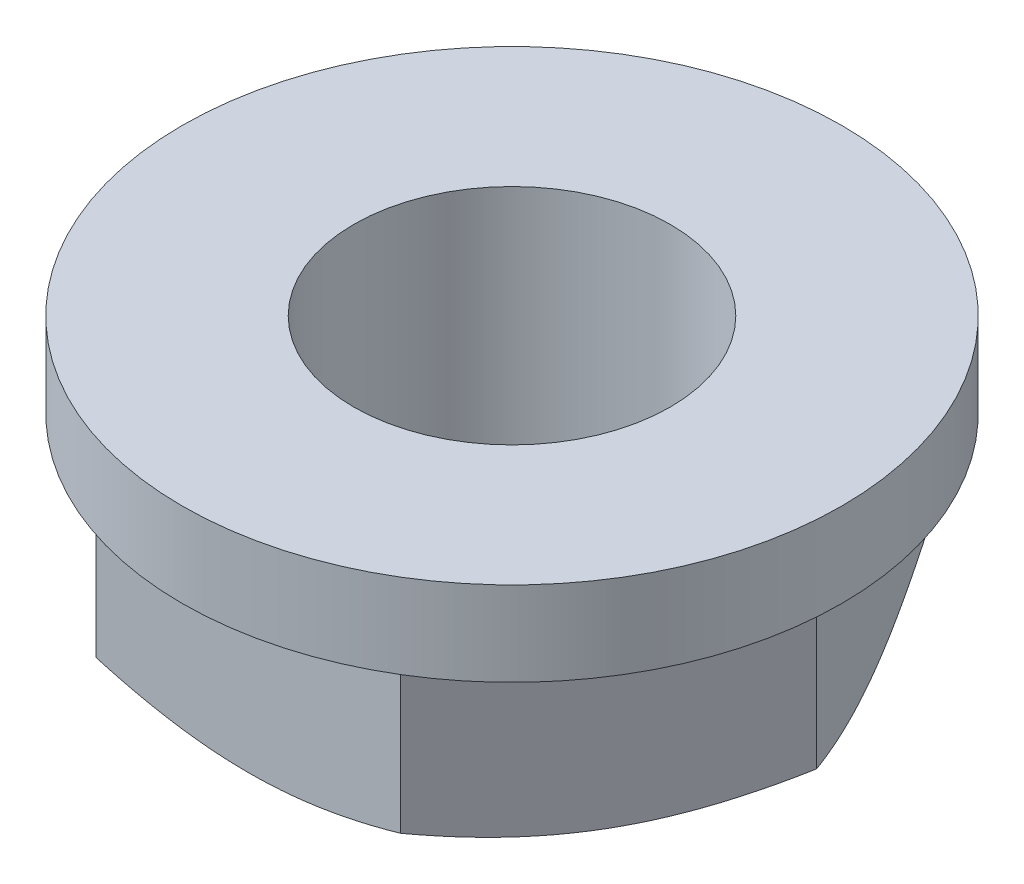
ISO-10303-21;
HEADER;
FILE_DESCRIPTION(('STEP AP214'),'2;1');
FILE_NAME('part.step','',(''),(''),'','','');
FILE_SCHEMA(('AUTOMOTIVE_DESIGN { 1 0 10303 214 1 1 1 1 }'));
ENDSEC;
DATA;
#1=APPLICATION_CONTEXT('core data for automotive mechanical design processes');
#2=APPLICATION_PROTOCOL_DEFINITION('international standard','automotive_design',2000,#1);
#3=PRODUCT_CONTEXT('',#1,'mechanical');
#4=PRODUCT('Part','Part','',(#3));
#5=PRODUCT_RELATED_PRODUCT_CATEGORY('part','',(#4));
#6=PRODUCT_DEFINITION_FORMATION('','',#4);
#7=PRODUCT_DEFINITION_CONTEXT('part definition',#1,'design');
#8=PRODUCT_DEFINITION('design','',#6,#7);
#9=PRODUCT_DEFINITION_SHAPE('','',#8);
#10=(LENGTH_UNIT() NAMED_UNIT(*) SI_UNIT(.MILLI.,.METRE.));
#11=(NAMED_UNIT(*) PLANE_ANGLE_UNIT() SI_UNIT($,.RADIAN.));
#12=(NAMED_UNIT(*) SI_UNIT($,.STERADIAN.) SOLID_ANGLE_UNIT());
#13=UNCERTAINTY_MEASURE_WITH_UNIT(LENGTH_MEASURE(1.E-05),#10,'distance_accuracy_value','');
#14=(GEOMETRIC_REPRESENTATION_CONTEXT(3) GLOBAL_UNCERTAINTY_ASSIGNED_CONTEXT((#13)) GLOBAL_UNIT_ASSIGNED_CONTEXT((#10,
#11,#12)) REPRESENTATION_CONTEXT('',''));
#15=CARTESIAN_POINT('',(0.,0.,0.));
#16=DIRECTION('',(0.,0.,1.));
#17=DIRECTION('',(1.,0.,0.));
#18=AXIS2_PLACEMENT_3D('',#15,#16,#17);
#19=CARTESIAN_POINT('',(0.,-4.77627677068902,0.));
#20=DIRECTION('',(0.,1.,0.));
#21=DIRECTION('',(-1.,0.,0.));
#22=AXIS2_PLACEMENT_3D('',#19,#20,#21);
#23=CONICAL_SURFACE('',#22,5.3875,1.0471975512);
#24=CARTESIAN_POINT('',(0.,-5.00000000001,5.00000000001));
#25=CARTESIAN_POINT('',(-1.33974596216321,-5.00000000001,5.00000000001));
#26=CARTESIAN_POINT('',(-2.88675134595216,-4.55341801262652,5.00000000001));
#27=(BOUNDED_CURVE() B_SPLINE_CURVE(2,(#24,#25,#26),.UNSPECIFIED.,.F.,
.F.) B_SPLINE_CURVE_WITH_KNOTS((3,3),(2.9316581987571,5.86058663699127),
.UNSPECIFIED.) CURVE() GEOMETRIC_REPRESENTATION_ITEM() RATIONAL_B_SPLINE_CURVE((1.,
1.03799156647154,1.00007075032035)) REPRESENTATION_ITEM(''));
#28=CARTESIAN_POINT('',(0.,-5.,5.));
#29=VERTEX_POINT('',#28);
#30=CARTESIAN_POINT('',(-2.88675134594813,-4.5534180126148,5.));
#31=VERTEX_POINT('',#30);
#32=EDGE_CURVE('E30',#29,#31,#27,.T.);
#33=ORIENTED_EDGE('',*,*,#32,.T.);
#34=CARTESIAN_POINT('',(-2.88675134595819,-4.55341801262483,5.0000000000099));
#35=CARTESIAN_POINT('',(-3.66025403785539,-5.0000000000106,3.66025403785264));
#36=CARTESIAN_POINT('',(-4.3301270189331,-5.00000000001,2.50000000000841));
#37=(BOUNDED_CURVE() B_SPLINE_CURVE(2,(#34,#35,#36),.UNSPECIFIED.,.F.,
.F.) B_SPLINE_CURVE_WITH_KNOTS((3,3),(0.00272976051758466,2.93165819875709),
.UNSPECIFIED.) CURVE() GEOMETRIC_REPRESENTATION_ITEM() RATIONAL_B_SPLINE_CURVE((1.00007075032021,
1.03799156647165,0.99999999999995)) REPRESENTATION_ITEM(''));
#38=CARTESIAN_POINT('',(-4.33012701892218,-5.,2.5));
#39=VERTEX_POINT('',#38);
#40=EDGE_CURVE('E204',#31,#39,#37,.T.);
#41=ORIENTED_EDGE('',*,*,#40,.T.);
#42=CARTESIAN_POINT('',(0.,-5.00000000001,0.));
#43=DIRECTION('',(0.,-1.,0.));
#44=DIRECTION('',(-1.,0.,0.));
#45=AXIS2_PLACEMENT_3D('',#42,#43,#44);
#46=CIRCLE('',#45,5.);
#47=EDGE_CURVE('E22',#29,#39,#46,.T.);
#48=ORIENTED_EDGE('',*,*,#47,.F.);
#49=EDGE_LOOP('',(#33,#41,#48));
#50=FACE_BOUND('',#49,.T.);
#51=ADVANCED_FACE('F18',(#50),#23,.T.);
#52=CARTESIAN_POINT('',(4.3301270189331,-5.00000000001,-2.50000000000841));
#53=CARTESIAN_POINT('',(5.00000000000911,-5.0000000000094,-1.33974596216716));
#54=CARTESIAN_POINT('',(5.7735026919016,-4.5534180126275,1.89407645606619E-12));
#55=(BOUNDED_CURVE() B_SPLINE_CURVE(2,(#52,#53,#54),.UNSPECIFIED.,.F.,
.F.) B_SPLINE_CURVE_WITH_KNOTS((3,3),(2.9316581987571,5.86058663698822),
.UNSPECIFIED.) CURVE() GEOMETRIC_REPRESENTATION_ITEM() RATIONAL_B_SPLINE_CURVE((1.00000000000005,
1.03799156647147,1.00007075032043)) REPRESENTATION_ITEM(''));
#56=CARTESIAN_POINT('',(4.33012701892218,-5.,-2.5));
#57=VERTEX_POINT('',#56);
#58=CARTESIAN_POINT('',(5.77350269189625,-4.5534180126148,0.));
#59=VERTEX_POINT('',#58);
#60=EDGE_CURVE('E152',#57,#59,#55,.T.);
#61=ORIENTED_EDGE('',*,*,#60,.T.);
#62=CARTESIAN_POINT('',(5.7735026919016,-4.5534180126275,-1.8916515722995E-12));
#63=CARTESIAN_POINT('',(5.00000000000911,-5.0000000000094,1.33974596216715));
#64=CARTESIAN_POINT('',(4.33012701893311,-5.00000000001,2.50000000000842));
#65=(BOUNDED_CURVE() B_SPLINE_CURVE(2,(#62,#63,#64),.UNSPECIFIED.,.F.,
.F.) B_SPLINE_CURVE_WITH_KNOTS((3,3),(0.00272976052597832,2.93165819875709),
.UNSPECIFIED.) CURVE() GEOMETRIC_REPRESENTATION_ITEM() RATIONAL_B_SPLINE_CURVE((1.00007075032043,
1.03799156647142,1.00000000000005)) REPRESENTATION_ITEM(''));
#66=CARTESIAN_POINT('',(4.3301270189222,-5.,2.5));
#67=VERTEX_POINT('',#66);
#68=EDGE_CURVE('E160',#59,#67,#65,.T.);
#69=ORIENTED_EDGE('',*,*,#68,.T.);
#70=EDGE_CURVE('E165',#57,#67,#46,.T.);
#71=ORIENTED_EDGE('',*,*,#70,.F.);
#72=EDGE_LOOP('',(#61,#69,#71));
#73=FACE_BOUND('',#72,.T.);
#74=ADVANCED_FACE('F20',(#73),#23,.T.);
#75=CARTESIAN_POINT('',(2.88675134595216,-4.55341801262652,5.00000000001));
#76=CARTESIAN_POINT('',(1.33974596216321,-5.00000000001,5.00000000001));
#77=CARTESIAN_POINT('',(0.,-5.00000000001,5.00000000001));
#78=(BOUNDED_CURVE() B_SPLINE_CURVE(2,(#75,#76,#77),.UNSPECIFIED.,.F.,
.F.) B_SPLINE_CURVE_WITH_KNOTS((3,3),(0.00272976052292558,2.9316581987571),
.UNSPECIFIED.) CURVE() GEOMETRIC_REPRESENTATION_ITEM() RATIONAL_B_SPLINE_CURVE((1.00007075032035,
1.03799156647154,1.)) REPRESENTATION_ITEM(''));
#79=CARTESIAN_POINT('',(2.88675134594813,-4.5534180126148,5.));
#80=VERTEX_POINT('',#79);
#81=EDGE_CURVE('E11',#80,#29,#78,.T.);
#82=ORIENTED_EDGE('',*,*,#81,.T.);
#83=EDGE_CURVE('E217',#67,#29,#46,.T.);
#84=ORIENTED_EDGE('',*,*,#83,.F.);
#85=CARTESIAN_POINT('',(4.33012701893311,-5.00000000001,2.50000000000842));
#86=CARTESIAN_POINT('',(3.66025403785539,-5.0000000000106,3.66025403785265));
#87=CARTESIAN_POINT('',(2.88675134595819,-4.55341801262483,5.00000000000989));
#88=(BOUNDED_CURVE() B_SPLINE_CURVE(2,(#85,#86,#87),.UNSPECIFIED.,.F.,
.F.) B_SPLINE_CURVE_WITH_KNOTS((3,3),(2.93165819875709,5.86058663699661),
.UNSPECIFIED.) CURVE() GEOMETRIC_REPRESENTATION_ITEM() RATIONAL_B_SPLINE_CURVE((0.99999999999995,
1.03799156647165,1.00007075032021)) REPRESENTATION_ITEM(''));
#89=EDGE_CURVE('E211',#67,#80,#88,.T.);
#90=ORIENTED_EDGE('',*,*,#89,.T.);
#91=EDGE_LOOP('',(#82,#84,#90));
#92=FACE_BOUND('',#91,.T.);
#93=ADVANCED_FACE('F261',(#92),#23,.T.);
#94=CARTESIAN_POINT('',(0.,1.,5.));
#95=DIRECTION('',(0.,0.,1.));
#96=DIRECTION('',(1.,0.,0.));
#97=AXIS2_PLACEMENT_3D('',#94,#95,#96);
#98=PLANE('',#97);
#99=DIRECTION('',(-1.,0.,0.));
#100=VECTOR('',#99,1.);
#101=CARTESIAN_POINT('',(2.36250000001,-1.60000000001,5.00000000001));
#102=LINE('',#101,#100);
#103=CARTESIAN_POINT('',(2.88675134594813,-1.6,5.));
#104=VERTEX_POINT('',#103);
#105=CARTESIAN_POINT('',(-2.88675134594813,-1.6,5.));
#106=VERTEX_POINT('',#105);
#107=EDGE_CURVE('E134',#104,#106,#102,.T.);
#108=ORIENTED_EDGE('',*,*,#107,.T.);
#109=DIRECTION('',(0.,-1.,0.));
#110=VECTOR('',#109,1.);
#111=CARTESIAN_POINT('',(-2.88675134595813,0.99999999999,5.00000000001));
#112=LINE('',#111,#110);
#113=EDGE_CURVE('E201',#106,#31,#112,.T.);
#114=ORIENTED_EDGE('',*,*,#113,.T.);
#115=ORIENTED_EDGE('',*,*,#32,.F.);
#116=ORIENTED_EDGE('',*,*,#81,.F.);
#117=DIRECTION('',(0.,-1.,0.));
#118=VECTOR('',#117,1.);
#119=CARTESIAN_POINT('',(2.88675134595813,0.99999999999,5.00000000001));
#120=LINE('',#119,#118);
#121=EDGE_CURVE('E207',#104,#80,#120,.T.);
#122=ORIENTED_EDGE('',*,*,#121,.F.);
#123=EDGE_LOOP('',(#108,#114,#115,#116,#122));
#124=FACE_BOUND('',#123,.T.);
#125=ADVANCED_FACE('F358',(#124),#98,.T.);
#126=CARTESIAN_POINT('',(2.88675134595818,-4.55341801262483,-5.00000000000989));
#127=CARTESIAN_POINT('',(3.66025403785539,-5.0000000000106,-3.66025403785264));
#128=CARTESIAN_POINT('',(4.33012701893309,-5.00000000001,-2.50000000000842));
#129=(BOUNDED_CURVE() B_SPLINE_CURVE(2,(#126,#127,#128),.UNSPECIFIED.,.F.,
.F.) B_SPLINE_CURVE_WITH_KNOTS((3,3),(0.00272976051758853,2.9316581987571),
.UNSPECIFIED.) CURVE() GEOMETRIC_REPRESENTATION_ITEM() RATIONAL_B_SPLINE_CURVE((1.00007075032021,
1.03799156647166,0.99999999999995)) REPRESENTATION_ITEM(''));
#130=CARTESIAN_POINT('',(2.88675134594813,-4.5534180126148,-5.));
#131=VERTEX_POINT('',#130);
#132=EDGE_CURVE('E104',#131,#57,#129,.T.);
#133=ORIENTED_EDGE('',*,*,#132,.T.);
#134=CARTESIAN_POINT('',(0.,-5.,-5.));
#135=VERTEX_POINT('',#134);
#136=EDGE_CURVE('E176',#135,#57,#46,.T.);
#137=ORIENTED_EDGE('',*,*,#136,.F.);
#138=CARTESIAN_POINT('',(0.,-5.00000000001,-5.00000000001));
#139=CARTESIAN_POINT('',(1.3397459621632,-5.00000000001,-5.00000000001));
#140=CARTESIAN_POINT('',(2.88675134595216,-4.55341801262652,-5.00000000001));
#141=(BOUNDED_CURVE() B_SPLINE_CURVE(2,(#138,#139,#140),.UNSPECIFIED.,.F.,
.F.) B_SPLINE_CURVE_WITH_KNOTS((3,3),(2.9316581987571,5.86058663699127),
.UNSPECIFIED.) CURVE() GEOMETRIC_REPRESENTATION_ITEM() RATIONAL_B_SPLINE_CURVE((1.,
1.03799156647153,1.00007075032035)) REPRESENTATION_ITEM(''));
#142=EDGE_CURVE('E185',#135,#131,#141,.T.);
#143=ORIENTED_EDGE('',*,*,#142,.T.);
#144=EDGE_LOOP('',(#133,#137,#143));
#145=FACE_BOUND('',#144,.T.);
#146=ADVANCED_FACE('F356',(#145),#23,.T.);
#147=CARTESIAN_POINT('',(-4.33012701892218,1.,-2.5));
#148=DIRECTION('',(-0.866025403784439,0.,-0.5));
#149=DIRECTION('',(-0.5,0.,0.866025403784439));
#150=AXIS2_PLACEMENT_3D('',#147,#148,#149);
#151=PLANE('',#150);
#152=DIRECTION('',(0.50000000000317,0.,-0.866025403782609));
#153=VECTOR('',#152,1.);
#154=CARTESIAN_POINT('',(-3.7395020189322,-1.60000000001,-3.52299250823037));
#155=LINE('',#154,#153);
#156=CARTESIAN_POINT('',(-5.77350269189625,-1.6,0.));
#157=VERTEX_POINT('',#156);
#158=CARTESIAN_POINT('',(-2.88675134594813,-1.6,-5.));
#159=VERTEX_POINT('',#158);
#160=EDGE_CURVE('E118',#157,#159,#155,.T.);
#161=ORIENTED_EDGE('',*,*,#160,.T.);
#162=DIRECTION('',(0.,-1.,0.));
#163=VECTOR('',#162,1.);
#164=CARTESIAN_POINT('',(-2.88675134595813,0.99999999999,-5.00000000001));
#165=LINE('',#164,#163);
#166=CARTESIAN_POINT('',(-2.88675134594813,-4.5534180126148,-5.));
#167=VERTEX_POINT('',#166);
#168=EDGE_CURVE('E113',#159,#167,#165,.T.);
#169=ORIENTED_EDGE('',*,*,#168,.T.);
#170=CARTESIAN_POINT('',(-4.3301270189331,-5.00000000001,-2.50000000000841));
#171=CARTESIAN_POINT('',(-3.66025403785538,-5.0000000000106,-3.66025403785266));
#172=CARTESIAN_POINT('',(-2.88675134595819,-4.55341801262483,-5.00000000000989));
#173=(BOUNDED_CURVE() B_SPLINE_CURVE(2,(#170,#171,#172),.UNSPECIFIED.,.F.,
.F.) B_SPLINE_CURVE_WITH_KNOTS((3,3),(2.9316581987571,5.86058663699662),
.UNSPECIFIED.) CURVE() GEOMETRIC_REPRESENTATION_ITEM() RATIONAL_B_SPLINE_CURVE((0.99999999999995,
1.03799156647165,1.00007075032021)) REPRESENTATION_ITEM(''));
#174=CARTESIAN_POINT('',(-4.33012701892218,-5.,-2.5));
#175=VERTEX_POINT('',#174);
#176=EDGE_CURVE('E224',#175,#167,#173,.T.);
#177=ORIENTED_EDGE('',*,*,#176,.F.);
#178=CARTESIAN_POINT('',(-5.7735026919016,-4.5534180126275,1.89292499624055E-12));
#179=CARTESIAN_POINT('',(-5.00000000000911,-5.0000000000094,-1.33974596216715));
#180=CARTESIAN_POINT('',(-4.3301270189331,-5.00000000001,-2.50000000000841));
#181=(BOUNDED_CURVE() B_SPLINE_CURVE(2,(#178,#179,#180),.UNSPECIFIED.,.F.,
.F.) B_SPLINE_CURVE_WITH_KNOTS((3,3),(0.0027297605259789,2.9316581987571),
.UNSPECIFIED.) CURVE() GEOMETRIC_REPRESENTATION_ITEM() RATIONAL_B_SPLINE_CURVE((1.00007075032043,
1.03799156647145,1.00000000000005)) REPRESENTATION_ITEM(''));
#182=CARTESIAN_POINT('',(-5.77350269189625,-4.5534180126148,0.));
#183=VERTEX_POINT('',#182);
#184=EDGE_CURVE('E301',#183,#175,#181,.T.);
#185=ORIENTED_EDGE('',*,*,#184,.F.);
#186=DIRECTION('',(0.,-1.,0.));
#187=VECTOR('',#186,1.);
#188=CARTESIAN_POINT('',(-5.77350269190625,0.99999999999,1.00003535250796E-11));
#189=LINE('',#188,#187);
#190=EDGE_CURVE('E63',#157,#183,#189,.T.);
#191=ORIENTED_EDGE('',*,*,#190,.F.);
#192=EDGE_LOOP('',(#161,#169,#177,#185,#191));
#193=FACE_BOUND('',#192,.T.);
#194=ADVANCED_FACE('F354',(#193),#151,.T.);
#195=CARTESIAN_POINT('',(-4.33012701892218,1.,2.5));
#196=DIRECTION('',(-0.866025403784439,0.,0.5));
#197=DIRECTION('',(0.,1.,0.));
#198=AXIS2_PLACEMENT_3D('',#195,#196,#197);
#199=PLANE('',#198);
#200=DIRECTION('',(-0.50000000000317,0.,-0.866025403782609));
#201=VECTOR('',#200,1.);
#202=CARTESIAN_POINT('',(-3.7395020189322,-1.60000000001,3.52299250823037));
#203=LINE('',#202,#201);
#204=EDGE_CURVE('E145',#106,#157,#203,.T.);
#205=ORIENTED_EDGE('',*,*,#204,.T.);
#206=ORIENTED_EDGE('',*,*,#190,.T.);
#207=CARTESIAN_POINT('',(-4.3301270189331,-5.00000000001,2.50000000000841));
#208=CARTESIAN_POINT('',(-5.00000000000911,-5.0000000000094,1.33974596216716));
#209=CARTESIAN_POINT('',(-5.77350269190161,-4.55341801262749,-1.89365932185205E-12));
#210=(BOUNDED_CURVE() B_SPLINE_CURVE(2,(#207,#208,#209),.UNSPECIFIED.,.F.,
.F.) B_SPLINE_CURVE_WITH_KNOTS((3,3),(2.93165819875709,5.86058663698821),
.UNSPECIFIED.) CURVE() GEOMETRIC_REPRESENTATION_ITEM() RATIONAL_B_SPLINE_CURVE((1.00000000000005,
1.03799156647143,1.00007075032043)) REPRESENTATION_ITEM(''));
#211=EDGE_CURVE('E159',#39,#183,#210,.T.);
#212=ORIENTED_EDGE('',*,*,#211,.F.);
#213=ORIENTED_EDGE('',*,*,#40,.F.);
#214=ORIENTED_EDGE('',*,*,#113,.F.);
#215=EDGE_LOOP('',(#205,#206,#212,#213,#214));
#216=FACE_BOUND('',#215,.T.);
#217=ADVANCED_FACE('F351',(#216),#199,.T.);
#218=CARTESIAN_POINT('',(0.,1.,-5.));
#219=DIRECTION('',(0.,0.,-1.));
#220=DIRECTION('',(0.,-1.,0.));
#221=AXIS2_PLACEMENT_3D('',#218,#219,#220);
#222=PLANE('',#221);
#223=DIRECTION('',(1.,0.,0.));
#224=VECTOR('',#223,1.);
#225=CARTESIAN_POINT('',(2.36250000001,-1.60000000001,-5.00000000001));
#226=LINE('',#225,#224);
#227=CARTESIAN_POINT('',(2.88675134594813,-1.6,-5.));
#228=VERTEX_POINT('',#227);
#229=EDGE_CURVE('E110',#159,#228,#226,.T.);
#230=ORIENTED_EDGE('',*,*,#229,.T.);
#231=DIRECTION('',(0.,-1.,0.));
#232=VECTOR('',#231,1.);
#233=CARTESIAN_POINT('',(2.88675134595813,0.99999999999,-5.00000000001));
#234=LINE('',#233,#232);
#235=EDGE_CURVE('E95',#228,#131,#234,.T.);
#236=ORIENTED_EDGE('',*,*,#235,.T.);
#237=ORIENTED_EDGE('',*,*,#142,.F.);
#238=CARTESIAN_POINT('',(-2.88675134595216,-4.55341801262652,-5.00000000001));
#239=CARTESIAN_POINT('',(-1.33974596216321,-5.00000000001,-5.00000000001));
#240=CARTESIAN_POINT('',(0.,-5.00000000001,-5.00000000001));
#241=(BOUNDED_CURVE() B_SPLINE_CURVE(2,(#238,#239,#240),.UNSPECIFIED.,.F.,
.F.) B_SPLINE_CURVE_WITH_KNOTS((3,3),(0.00272976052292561,2.9316581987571),
.UNSPECIFIED.) CURVE() GEOMETRIC_REPRESENTATION_ITEM() RATIONAL_B_SPLINE_CURVE((1.00007075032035,
1.03799156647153,1.)) REPRESENTATION_ITEM(''));
#242=EDGE_CURVE('E188',#167,#135,#241,.T.);
#243=ORIENTED_EDGE('',*,*,#242,.F.);
#244=ORIENTED_EDGE('',*,*,#168,.F.);
#245=EDGE_LOOP('',(#230,#236,#237,#243,#244));
#246=FACE_BOUND('',#245,.T.);
#247=ADVANCED_FACE('F111',(#246),#222,.T.);
#248=ORIENTED_EDGE('',*,*,#176,.T.);
#249=ORIENTED_EDGE('',*,*,#242,.T.);
#250=EDGE_CURVE('E174',#175,#135,#46,.T.);
#251=ORIENTED_EDGE('',*,*,#250,.F.);
#252=EDGE_LOOP('',(#248,#249,#251));
#253=FACE_BOUND('',#252,.T.);
#254=ADVANCED_FACE('F347',(#253),#23,.T.);
#255=CARTESIAN_POINT('',(-4.3875,0.,0.));
#256=DIRECTION('',(0.,1.,0.));
#257=DIRECTION('',(1.,0.,0.));
#258=AXIS2_PLACEMENT_3D('',#255,#256,#257);
#259=PLANE('',#258);
#260=CARTESIAN_POINT('',(0.,0.,0.));
#261=DIRECTION('',(0.,1.,0.));
#262=DIRECTION('',(0.,0.,1.));
#263=AXIS2_PLACEMENT_3D('',#260,#261,#262);
#264=CIRCLE('',#263,3.);
#265=CARTESIAN_POINT('',(0.,0.,3.));
#266=VERTEX_POINT('',#265);
#267=EDGE_CURVE('E314',#266,#266,#264,.T.);
#268=ORIENTED_EDGE('',*,*,#267,.F.);
#269=EDGE_LOOP('',(#268));
#270=FACE_BOUND('',#269,.T.);
#271=CARTESIAN_POINT('',(0.,-9.9998134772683E-12,0.));
#272=DIRECTION('',(0.,1.,0.));
#273=DIRECTION('',(1.,0.,0.));
#274=AXIS2_PLACEMENT_3D('',#271,#272,#273);
#275=CIRCLE('',#274,6.25);
#276=CARTESIAN_POINT('',(6.25,-9.9998134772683E-12,0.));
#277=VERTEX_POINT('',#276);
#278=EDGE_CURVE('E107',#277,#277,#275,.T.);
#279=ORIENTED_EDGE('',*,*,#278,.T.);
#280=EDGE_LOOP('',(#279));
#281=FACE_BOUND('',#280,.T.);
#282=ADVANCED_FACE('F344',(#270,#281),#259,.T.);
#283=CARTESIAN_POINT('',(-4.,-5.,0.));
#284=DIRECTION('',(0.,-1.,0.));
#285=DIRECTION('',(-1.,0.,0.));
#286=AXIS2_PLACEMENT_3D('',#283,#284,#285);
#287=PLANE('',#286);
#288=CARTESIAN_POINT('',(0.,-4.99999999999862,0.));
#289=DIRECTION('',(0.,-1.,0.));
#290=DIRECTION('',(1.,0.,0.));
#291=AXIS2_PLACEMENT_3D('',#288,#289,#290);
#292=CIRCLE('',#291,3.);
#293=CARTESIAN_POINT('',(3.,-4.99999999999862,0.));
#294=VERTEX_POINT('',#293);
#295=EDGE_CURVE('E138',#294,#294,#292,.F.);
#296=ORIENTED_EDGE('',*,*,#295,.T.);
#297=EDGE_LOOP('',(#296));
#298=FACE_BOUND('',#297,.T.);
#299=ORIENTED_EDGE('',*,*,#47,.T.);
#300=EDGE_CURVE('E155',#39,#175,#46,.T.);
#301=ORIENTED_EDGE('',*,*,#300,.T.);
#302=ORIENTED_EDGE('',*,*,#250,.T.);
#303=ORIENTED_EDGE('',*,*,#136,.T.);
#304=ORIENTED_EDGE('',*,*,#70,.T.);
#305=ORIENTED_EDGE('',*,*,#83,.T.);
#306=EDGE_LOOP('',(#299,#301,#302,#303,#304,#305));
#307=FACE_BOUND('',#306,.T.);
#308=ADVANCED_FACE('F264',(#298,#307),#287,.T.);
#309=ORIENTED_EDGE('',*,*,#300,.F.);
#310=ORIENTED_EDGE('',*,*,#211,.T.);
#311=ORIENTED_EDGE('',*,*,#184,.T.);
#312=EDGE_LOOP('',(#309,#310,#311));
#313=FACE_BOUND('',#312,.T.);
#314=ADVANCED_FACE('F307',(#313),#23,.T.);
#315=CARTESIAN_POINT('',(4.3301270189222,1.,2.5));
#316=DIRECTION('',(0.866025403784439,0.,0.5));
#317=DIRECTION('',(0.,-1.,0.));
#318=AXIS2_PLACEMENT_3D('',#315,#316,#317);
#319=PLANE('',#318);
#320=DIRECTION('',(-0.50000000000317,0.,0.866025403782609));
#321=VECTOR('',#320,1.);
#322=CARTESIAN_POINT('',(4.9207520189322,-1.60000000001,1.47700749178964));
#323=LINE('',#322,#321);
#324=CARTESIAN_POINT('',(5.77350269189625,-1.6,0.));
#325=VERTEX_POINT('',#324);
#326=EDGE_CURVE('E125',#325,#104,#323,.T.);
#327=ORIENTED_EDGE('',*,*,#326,.T.);
#328=ORIENTED_EDGE('',*,*,#121,.T.);
#329=ORIENTED_EDGE('',*,*,#89,.F.);
#330=ORIENTED_EDGE('',*,*,#68,.F.);
#331=DIRECTION('',(0.,-1.,0.));
#332=VECTOR('',#331,1.);
#333=CARTESIAN_POINT('',(5.77350269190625,0.99999999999,-1.00010605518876E-11));
#334=LINE('',#333,#332);
#335=EDGE_CURVE('E149',#325,#59,#334,.T.);
#336=ORIENTED_EDGE('',*,*,#335,.F.);
#337=EDGE_LOOP('',(#327,#328,#329,#330,#336));
#338=FACE_BOUND('',#337,.T.);
#339=ADVANCED_FACE('F260',(#338),#319,.T.);
#340=CARTESIAN_POINT('',(0.,-0.8,0.));
#341=DIRECTION('',(0.,-1.,0.));
#342=DIRECTION('',(1.,0.,0.));
#343=AXIS2_PLACEMENT_3D('',#340,#341,#342);
#344=CYLINDRICAL_SURFACE('',#343,6.25);
#345=ORIENTED_EDGE('',*,*,#278,.F.);
#346=EDGE_LOOP('',(#345));
#347=FACE_BOUND('',#346,.T.);
#348=CARTESIAN_POINT('',(0.,-1.60000000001,0.));
#349=DIRECTION('',(0.,1.,0.));
#350=DIRECTION('',(1.,0.,0.));
#351=AXIS2_PLACEMENT_3D('',#348,#349,#350);
#352=CIRCLE('',#351,6.25);
#353=CARTESIAN_POINT('',(6.25,-1.60000000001,0.));
#354=VERTEX_POINT('',#353);
#355=EDGE_CURVE('E142',#354,#354,#352,.T.);
#356=ORIENTED_EDGE('',*,*,#355,.T.);
#357=EDGE_LOOP('',(#356));
#358=FACE_BOUND('',#357,.T.);
#359=ADVANCED_FACE('F336',(#347,#358),#344,.T.);
#360=CARTESIAN_POINT('',(4.3301270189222,1.,-2.5));
#361=DIRECTION('',(0.866025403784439,0.,-0.5));
#362=DIRECTION('',(0.,-1.,0.));
#363=AXIS2_PLACEMENT_3D('',#360,#361,#362);
#364=PLANE('',#363);
#365=DIRECTION('',(0.50000000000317,0.,0.866025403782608));
#366=VECTOR('',#365,1.);
#367=CARTESIAN_POINT('',(4.9207520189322,-1.60000000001,-1.47700749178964));
#368=LINE('',#367,#366);
#369=EDGE_CURVE('E100',#228,#325,#368,.T.);
#370=ORIENTED_EDGE('',*,*,#369,.T.);
#371=ORIENTED_EDGE('',*,*,#335,.T.);
#372=ORIENTED_EDGE('',*,*,#60,.F.);
#373=ORIENTED_EDGE('',*,*,#132,.F.);
#374=ORIENTED_EDGE('',*,*,#235,.F.);
#375=EDGE_LOOP('',(#370,#371,#372,#373,#374));
#376=FACE_BOUND('',#375,.T.);
#377=ADVANCED_FACE('F97',(#376),#364,.T.);
#378=CARTESIAN_POINT('',(4.725,-1.6,0.));
#379=DIRECTION('',(0.,-1.,0.));
#380=DIRECTION('',(0.,0.,-1.));
#381=AXIS2_PLACEMENT_3D('',#378,#379,#380);
#382=PLANE('',#381);
#383=ORIENTED_EDGE('',*,*,#204,.F.);
#384=ORIENTED_EDGE('',*,*,#107,.F.);
#385=ORIENTED_EDGE('',*,*,#326,.F.);
#386=ORIENTED_EDGE('',*,*,#369,.F.);
#387=ORIENTED_EDGE('',*,*,#229,.F.);
#388=ORIENTED_EDGE('',*,*,#160,.F.);
#389=EDGE_LOOP('',(#383,#384,#385,#386,#387,#388));
#390=FACE_BOUND('',#389,.T.);
#391=ORIENTED_EDGE('',*,*,#355,.F.);
#392=EDGE_LOOP('',(#391));
#393=FACE_BOUND('',#392,.T.);
#394=ADVANCED_FACE('F121',(#390,#393),#382,.T.);
#395=CARTESIAN_POINT('',(0.,-5.0025,0.));
#396=DIRECTION('',(0.,1.,0.));
#397=DIRECTION('',(0.,0.,1.));
#398=AXIS2_PLACEMENT_3D('',#395,#396,#397);
#399=CYLINDRICAL_SURFACE('',#398,3.);
#400=ORIENTED_EDGE('',*,*,#267,.T.);
#401=EDGE_LOOP('',(#400));
#402=FACE_BOUND('',#401,.T.);
#403=ORIENTED_EDGE('',*,*,#295,.F.);
#404=EDGE_LOOP('',(#403));
#405=FACE_BOUND('',#404,.T.);
#406=ADVANCED_FACE('F323',(#402,#405),#399,.F.);
#407=CLOSED_SHELL('',(#51,#74,#93,#125,#146,#194,#217,#247,#254,#282,#308,#314,#339,#359,#377,
#394,#406));
#408=MANIFOLD_SOLID_BREP('B1',#407);
#409=ADVANCED_BREP_SHAPE_REPRESENTATION('',(#18,#408),#14);
#410=SHAPE_DEFINITION_REPRESENTATION(#9,#409);
ENDSEC;
END-ISO-10303-21;
